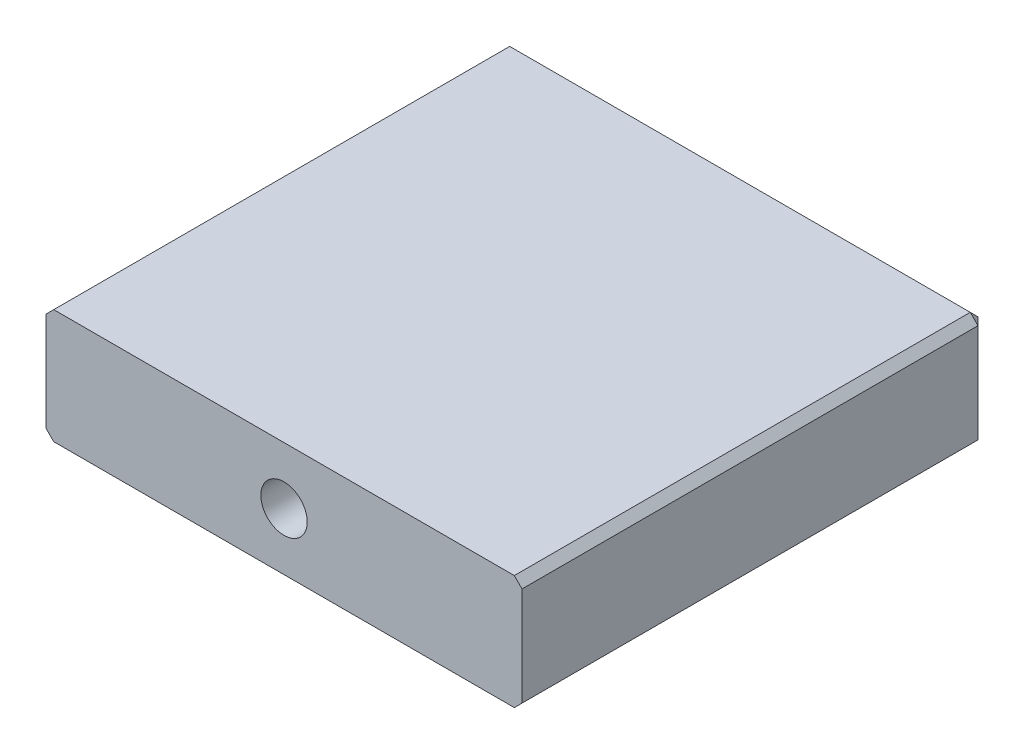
from build123d import *

# Parameters (mm, degrees)
ESQUISSE1_W        = 15.4
ESQUISSE1_H        = 3.7
ESQUISSE1_R        = 0.75
BOSS_EXTRU_1_DEPTH = 15
CHANFREIN1_SIZE    = 0.25


with BuildPart() as part:
    # Esquisse1 → Boss.-Extru.1 (new body)
    with BuildSketch(Plane.XY):
        with Locations((7.7, 1.85)):
            Rectangle(ESQUISSE1_W, ESQUISSE1_H)
        with Locations((7.7, 1.85)):
            Circle(ESQUISSE1_R, mode=Mode.SUBTRACT)
    extrude(amount=BOSS_EXTRU_1_DEPTH)

    # Chanfrein1
    chanfrein1_edges = [part.edges().sort_by_distance(p)[0] for p in [
        (7.7, 3.7, 0),
        (15.4, 1.85, 0),
        (7.7, 0, 0),
        (0, 1.85, 0),
        (0, 3.7, 7.5),
        (15.4, 3.7, 7.5),
        (15.4, 0, 7.5),
        (0, 0, 7.5),
    ]]
    chamfer(chanfrein1_edges, length=CHANFREIN1_SIZE)


solid = part.part
